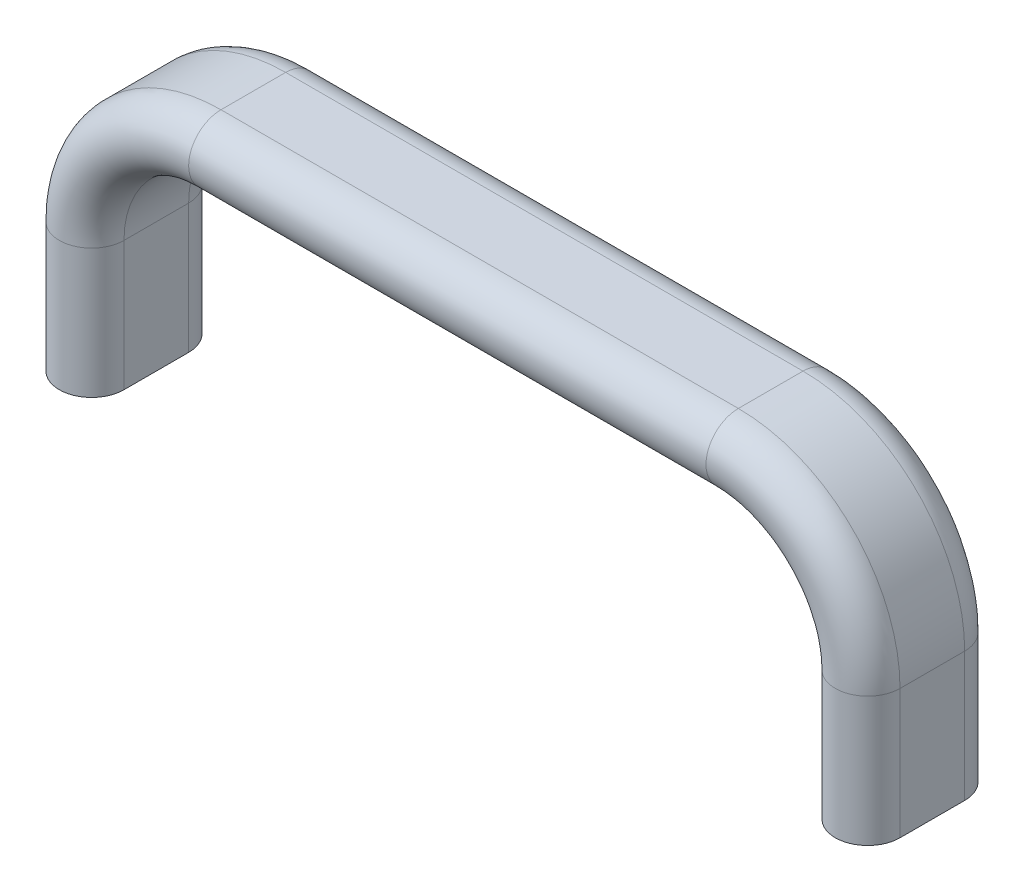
ISO-10303-21;
HEADER;
FILE_DESCRIPTION(('STEP AP214'),'2;1');
FILE_NAME('part.step','',(''),(''),'','','');
FILE_SCHEMA(('AUTOMOTIVE_DESIGN { 1 0 10303 214 1 1 1 1 }'));
ENDSEC;
DATA;
#1=APPLICATION_CONTEXT('core data for automotive mechanical design processes');
#2=APPLICATION_PROTOCOL_DEFINITION('international standard','automotive_design',2000,#1);
#3=PRODUCT_CONTEXT('',#1,'mechanical');
#4=PRODUCT('Part','Part','',(#3));
#5=PRODUCT_RELATED_PRODUCT_CATEGORY('part','',(#4));
#6=PRODUCT_DEFINITION_FORMATION('','',#4);
#7=PRODUCT_DEFINITION_CONTEXT('part definition',#1,'design');
#8=PRODUCT_DEFINITION('design','',#6,#7);
#9=PRODUCT_DEFINITION_SHAPE('','',#8);
#10=(LENGTH_UNIT() NAMED_UNIT(*) SI_UNIT(.MILLI.,.METRE.));
#11=(NAMED_UNIT(*) PLANE_ANGLE_UNIT() SI_UNIT($,.RADIAN.));
#12=(NAMED_UNIT(*) SI_UNIT($,.STERADIAN.) SOLID_ANGLE_UNIT());
#13=UNCERTAINTY_MEASURE_WITH_UNIT(LENGTH_MEASURE(1.E-05),#10,'distance_accuracy_value','');
#14=(GEOMETRIC_REPRESENTATION_CONTEXT(3) GLOBAL_UNCERTAINTY_ASSIGNED_CONTEXT((#13)) GLOBAL_UNIT_ASSIGNED_CONTEXT((#10,
#11,#12)) REPRESENTATION_CONTEXT('',''));
#15=CARTESIAN_POINT('',(0.,0.,0.));
#16=DIRECTION('',(0.,0.,1.));
#17=DIRECTION('',(1.,0.,0.));
#18=AXIS2_PLACEMENT_3D('',#15,#16,#17);
#19=CARTESIAN_POINT('',(60.,0.,-4.99999999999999));
#20=DIRECTION('',(0.,1.,0.));
#21=DIRECTION('',(0.,0.,-1.));
#22=AXIS2_PLACEMENT_3D('',#19,#20,#21);
#23=PLANE('',#22);
#24=CARTESIAN_POINT('',(60.,0.,-4.99999999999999));
#25=DIRECTION('',(0.,-1.,0.));
#26=DIRECTION('',(0.,0.,-1.));
#27=AXIS2_PLACEMENT_3D('',#24,#25,#26);
#28=CIRCLE('',#27,5.);
#29=CARTESIAN_POINT('',(55.,0.,-4.99999999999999));
#30=VERTEX_POINT('',#29);
#31=CARTESIAN_POINT('',(65.,0.,-4.99999999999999));
#32=VERTEX_POINT('',#31);
#33=EDGE_CURVE('E278',#30,#32,#28,.T.);
#34=ORIENTED_EDGE('',*,*,#33,.T.);
#35=DIRECTION('',(0.,0.,1.));
#36=VECTOR('',#35,1.);
#37=CARTESIAN_POINT('',(65.,0.,5.00000000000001));
#38=LINE('',#37,#36);
#39=CARTESIAN_POINT('',(65.,0.,5.00000000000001));
#40=VERTEX_POINT('',#39);
#41=EDGE_CURVE('E55',#32,#40,#38,.T.);
#42=ORIENTED_EDGE('',*,*,#41,.T.);
#43=CARTESIAN_POINT('',(60.,0.,5.00000000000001));
#44=DIRECTION('',(0.,-1.,0.));
#45=DIRECTION('',(0.,0.,1.));
#46=AXIS2_PLACEMENT_3D('',#43,#44,#45);
#47=CIRCLE('',#46,5.);
#48=CARTESIAN_POINT('',(55.,0.,5.00000000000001));
#49=VERTEX_POINT('',#48);
#50=EDGE_CURVE('E63',#40,#49,#47,.T.);
#51=ORIENTED_EDGE('',*,*,#50,.T.);
#52=DIRECTION('',(0.,0.,-1.));
#53=VECTOR('',#52,1.);
#54=CARTESIAN_POINT('',(55.,0.,-4.99999999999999));
#55=LINE('',#54,#53);
#56=EDGE_CURVE('E281',#49,#30,#55,.T.);
#57=ORIENTED_EDGE('',*,*,#56,.T.);
#58=EDGE_LOOP('',(#34,#42,#51,#57));
#59=FACE_BOUND('',#58,.T.);
#60=CARTESIAN_POINT('',(60.,0.,0.));
#61=DIRECTION('',(0.,1.,0.));
#62=DIRECTION('',(0.,0.,-1.));
#63=AXIS2_PLACEMENT_3D('',#60,#61,#62);
#64=CIRCLE('',#63,2.5);
#65=CARTESIAN_POINT('',(60.,0.,-2.5));
#66=VERTEX_POINT('',#65);
#67=EDGE_CURVE('E443',#66,#66,#64,.T.);
#68=ORIENTED_EDGE('',*,*,#67,.T.);
#69=EDGE_LOOP('',(#68));
#70=FACE_BOUND('',#69,.T.);
#71=ADVANCED_FACE('F37',(#59,#70),#23,.F.);
#72=CARTESIAN_POINT('',(65.,20.,5.00000000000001));
#73=DIRECTION('',(1.,0.,0.));
#74=DIRECTION('',(0.,0.,-1.));
#75=AXIS2_PLACEMENT_3D('',#72,#73,#74);
#76=PLANE('',#75);
#77=DIRECTION('',(0.,0.,1.));
#78=VECTOR('',#77,1.);
#79=CARTESIAN_POINT('',(65.,20.,5.00000000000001));
#80=LINE('',#79,#78);
#81=CARTESIAN_POINT('',(65.,20.,-4.99999999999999));
#82=VERTEX_POINT('',#81);
#83=CARTESIAN_POINT('',(65.,20.,5.00000000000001));
#84=VERTEX_POINT('',#83);
#85=EDGE_CURVE('E247',#82,#84,#80,.T.);
#86=ORIENTED_EDGE('',*,*,#85,.T.);
#87=DIRECTION('',(0.,-1.,0.));
#88=VECTOR('',#87,1.);
#89=CARTESIAN_POINT('',(65.,20.,5.00000000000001));
#90=LINE('',#89,#88);
#91=EDGE_CURVE('E47',#84,#40,#90,.T.);
#92=ORIENTED_EDGE('',*,*,#91,.T.);
#93=ORIENTED_EDGE('',*,*,#41,.F.);
#94=DIRECTION('',(0.,-1.,0.));
#95=VECTOR('',#94,1.);
#96=CARTESIAN_POINT('',(65.,20.,-4.99999999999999));
#97=LINE('',#96,#95);
#98=EDGE_CURVE('E11',#82,#32,#97,.T.);
#99=ORIENTED_EDGE('',*,*,#98,.F.);
#100=EDGE_LOOP('',(#86,#92,#93,#99));
#101=FACE_BOUND('',#100,.T.);
#102=ADVANCED_FACE('F39',(#101),#76,.T.);
#103=CARTESIAN_POINT('',(60.,20.,5.00000000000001));
#104=DIRECTION('',(0.,-1.,0.));
#105=DIRECTION('',(0.,0.,-1.));
#106=AXIS2_PLACEMENT_3D('',#103,#104,#105);
#107=CYLINDRICAL_SURFACE('',#106,5.);
#108=CARTESIAN_POINT('',(60.,20.,5.00000000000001));
#109=DIRECTION('',(0.,-1.,0.));
#110=DIRECTION('',(0.,0.,1.));
#111=AXIS2_PLACEMENT_3D('',#108,#109,#110);
#112=CIRCLE('',#111,5.);
#113=CARTESIAN_POINT('',(55.,20.,5.00000000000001));
#114=VERTEX_POINT('',#113);
#115=EDGE_CURVE('E240',#84,#114,#112,.T.);
#116=ORIENTED_EDGE('',*,*,#115,.T.);
#117=DIRECTION('',(0.,-1.,0.));
#118=VECTOR('',#117,1.);
#119=CARTESIAN_POINT('',(55.,20.,5.00000000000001));
#120=LINE('',#119,#118);
#121=EDGE_CURVE('E242',#114,#49,#120,.T.);
#122=ORIENTED_EDGE('',*,*,#121,.T.);
#123=ORIENTED_EDGE('',*,*,#50,.F.);
#124=ORIENTED_EDGE('',*,*,#91,.F.);
#125=EDGE_LOOP('',(#116,#122,#123,#124));
#126=FACE_BOUND('',#125,.T.);
#127=ADVANCED_FACE('F153',(#126),#107,.T.);
#128=CARTESIAN_POINT('',(55.,20.,-4.99999999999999));
#129=DIRECTION('',(-1.,0.,0.));
#130=DIRECTION('',(0.,0.,1.));
#131=AXIS2_PLACEMENT_3D('',#128,#129,#130);
#132=PLANE('',#131);
#133=DIRECTION('',(0.,0.,-1.));
#134=VECTOR('',#133,1.);
#135=CARTESIAN_POINT('',(55.,20.,-4.99999999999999));
#136=LINE('',#135,#134);
#137=CARTESIAN_POINT('',(55.,20.,-4.99999999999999));
#138=VERTEX_POINT('',#137);
#139=EDGE_CURVE('E248',#114,#138,#136,.T.);
#140=ORIENTED_EDGE('',*,*,#139,.T.);
#141=DIRECTION('',(0.,-1.,0.));
#142=VECTOR('',#141,1.);
#143=CARTESIAN_POINT('',(55.,20.,-4.99999999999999));
#144=LINE('',#143,#142);
#145=EDGE_CURVE('E289',#138,#30,#144,.T.);
#146=ORIENTED_EDGE('',*,*,#145,.T.);
#147=ORIENTED_EDGE('',*,*,#56,.F.);
#148=ORIENTED_EDGE('',*,*,#121,.F.);
#149=EDGE_LOOP('',(#140,#146,#147,#148));
#150=FACE_BOUND('',#149,.T.);
#151=ADVANCED_FACE('F231',(#150),#132,.T.);
#152=CARTESIAN_POINT('',(60.,20.,-4.99999999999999));
#153=DIRECTION('',(0.,-1.,0.));
#154=DIRECTION('',(0.,0.,-1.));
#155=AXIS2_PLACEMENT_3D('',#152,#153,#154);
#156=CYLINDRICAL_SURFACE('',#155,5.);
#157=CARTESIAN_POINT('',(60.,20.,-4.99999999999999));
#158=DIRECTION('',(0.,-1.,0.));
#159=DIRECTION('',(0.,0.,-1.));
#160=AXIS2_PLACEMENT_3D('',#157,#158,#159);
#161=CIRCLE('',#160,5.);
#162=EDGE_CURVE('E259',#138,#82,#161,.T.);
#163=ORIENTED_EDGE('',*,*,#162,.T.);
#164=ORIENTED_EDGE('',*,*,#98,.T.);
#165=ORIENTED_EDGE('',*,*,#33,.F.);
#166=ORIENTED_EDGE('',*,*,#145,.F.);
#167=EDGE_LOOP('',(#163,#164,#165,#166));
#168=FACE_BOUND('',#167,.T.);
#169=ADVANCED_FACE('F227',(#168),#156,.T.);
#170=CARTESIAN_POINT('',(40.,20.,0.));
#171=DIRECTION('',(0.,0.,-1.));
#172=DIRECTION('',(-1.,0.,0.));
#173=AXIS2_PLACEMENT_3D('',#170,#171,#172);
#174=CYLINDRICAL_SURFACE('',#173,25.);
#175=DIRECTION('',(0.,0.,1.));
#176=VECTOR('',#175,1.);
#177=CARTESIAN_POINT('',(40.,45.,5.00000000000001));
#178=LINE('',#177,#176);
#179=CARTESIAN_POINT('',(40.,45.,-4.99999999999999));
#180=VERTEX_POINT('',#179);
#181=CARTESIAN_POINT('',(40.,45.,5.00000000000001));
#182=VERTEX_POINT('',#181);
#183=EDGE_CURVE('E399',#180,#182,#178,.T.);
#184=ORIENTED_EDGE('',*,*,#183,.T.);
#185=CARTESIAN_POINT('',(40.,20.,5.00000000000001));
#186=DIRECTION('',(0.,0.,-1.));
#187=DIRECTION('',(-1.,0.,0.));
#188=AXIS2_PLACEMENT_3D('',#185,#186,#187);
#189=CIRCLE('',#188,25.);
#190=EDGE_CURVE('E265',#182,#84,#189,.T.);
#191=ORIENTED_EDGE('',*,*,#190,.T.);
#192=ORIENTED_EDGE('',*,*,#85,.F.);
#193=CARTESIAN_POINT('',(40.,20.,-4.99999999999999));
#194=DIRECTION('',(0.,0.,-1.));
#195=DIRECTION('',(-1.,0.,0.));
#196=AXIS2_PLACEMENT_3D('',#193,#194,#195);
#197=CIRCLE('',#196,25.);
#198=EDGE_CURVE('E269',#180,#82,#197,.T.);
#199=ORIENTED_EDGE('',*,*,#198,.F.);
#200=EDGE_LOOP('',(#184,#191,#192,#199));
#201=FACE_BOUND('',#200,.T.);
#202=ADVANCED_FACE('F223',(#201),#174,.T.);
#203=CARTESIAN_POINT('',(40.,20.,5.00000000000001));
#204=DIRECTION('',(0.,0.,-1.));
#205=DIRECTION('',(-1.,0.,0.));
#206=AXIS2_PLACEMENT_3D('',#203,#204,#205);
#207=TOROIDAL_SURFACE('',#206,20.,5.);
#208=CARTESIAN_POINT('',(40.,40.,5.00000000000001));
#209=DIRECTION('',(1.,0.,0.));
#210=DIRECTION('',(0.,0.,1.));
#211=AXIS2_PLACEMENT_3D('',#208,#209,#210);
#212=CIRCLE('',#211,5.);
#213=CARTESIAN_POINT('',(40.,35.,5.00000000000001));
#214=VERTEX_POINT('',#213);
#215=EDGE_CURVE('E262',#182,#214,#212,.T.);
#216=ORIENTED_EDGE('',*,*,#215,.T.);
#217=CARTESIAN_POINT('',(40.,20.,5.00000000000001));
#218=DIRECTION('',(0.,0.,-1.));
#219=DIRECTION('',(-1.,0.,0.));
#220=AXIS2_PLACEMENT_3D('',#217,#218,#219);
#221=CIRCLE('',#220,15.);
#222=EDGE_CURVE('E253',#214,#114,#221,.T.);
#223=ORIENTED_EDGE('',*,*,#222,.T.);
#224=ORIENTED_EDGE('',*,*,#115,.F.);
#225=ORIENTED_EDGE('',*,*,#190,.F.);
#226=EDGE_LOOP('',(#216,#223,#224,#225));
#227=FACE_BOUND('',#226,.T.);
#228=ADVANCED_FACE('F219',(#227),#207,.T.);
#229=CARTESIAN_POINT('',(40.,20.,0.));
#230=DIRECTION('',(0.,0.,-1.));
#231=DIRECTION('',(-1.,0.,0.));
#232=AXIS2_PLACEMENT_3D('',#229,#230,#231);
#233=CYLINDRICAL_SURFACE('',#232,15.);
#234=DIRECTION('',(0.,0.,-1.));
#235=VECTOR('',#234,1.);
#236=CARTESIAN_POINT('',(40.,35.,-4.99999999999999));
#237=LINE('',#236,#235);
#238=CARTESIAN_POINT('',(40.,35.,-4.99999999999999));
#239=VERTEX_POINT('',#238);
#240=EDGE_CURVE('E394',#214,#239,#237,.T.);
#241=ORIENTED_EDGE('',*,*,#240,.T.);
#242=CARTESIAN_POINT('',(40.,20.,-4.99999999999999));
#243=DIRECTION('',(0.,0.,-1.));
#244=DIRECTION('',(-1.,0.,0.));
#245=AXIS2_PLACEMENT_3D('',#242,#243,#244);
#246=CIRCLE('',#245,15.);
#247=EDGE_CURVE('E255',#239,#138,#246,.T.);
#248=ORIENTED_EDGE('',*,*,#247,.T.);
#249=ORIENTED_EDGE('',*,*,#139,.F.);
#250=ORIENTED_EDGE('',*,*,#222,.F.);
#251=EDGE_LOOP('',(#241,#248,#249,#250));
#252=FACE_BOUND('',#251,.T.);
#253=ADVANCED_FACE('F215',(#252),#233,.F.);
#254=CARTESIAN_POINT('',(40.,20.,-4.99999999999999));
#255=DIRECTION('',(0.,0.,-1.));
#256=DIRECTION('',(-1.,0.,0.));
#257=AXIS2_PLACEMENT_3D('',#254,#255,#256);
#258=TOROIDAL_SURFACE('',#257,20.,5.);
#259=CARTESIAN_POINT('',(40.,40.,-4.99999999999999));
#260=DIRECTION('',(1.,0.,0.));
#261=DIRECTION('',(0.,0.,-1.));
#262=AXIS2_PLACEMENT_3D('',#259,#260,#261);
#263=CIRCLE('',#262,5.);
#264=EDGE_CURVE('E390',#239,#180,#263,.T.);
#265=ORIENTED_EDGE('',*,*,#264,.T.);
#266=ORIENTED_EDGE('',*,*,#198,.T.);
#267=ORIENTED_EDGE('',*,*,#162,.F.);
#268=ORIENTED_EDGE('',*,*,#247,.F.);
#269=EDGE_LOOP('',(#265,#266,#267,#268));
#270=FACE_BOUND('',#269,.T.);
#271=ADVANCED_FACE('F211',(#270),#258,.T.);
#272=CARTESIAN_POINT('',(-40.,45.,5.00000000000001));
#273=DIRECTION('',(0.,1.,0.));
#274=DIRECTION('',(-1.,0.,0.));
#275=AXIS2_PLACEMENT_3D('',#272,#273,#274);
#276=PLANE('',#275);
#277=DIRECTION('',(0.,0.,1.));
#278=VECTOR('',#277,1.);
#279=CARTESIAN_POINT('',(-40.,45.,5.00000000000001));
#280=LINE('',#279,#278);
#281=CARTESIAN_POINT('',(-40.,45.,-4.99999999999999));
#282=VERTEX_POINT('',#281);
#283=CARTESIAN_POINT('',(-40.,45.,5.00000000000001));
#284=VERTEX_POINT('',#283);
#285=EDGE_CURVE('E371',#282,#284,#280,.T.);
#286=ORIENTED_EDGE('',*,*,#285,.T.);
#287=DIRECTION('',(1.,0.,0.));
#288=VECTOR('',#287,1.);
#289=CARTESIAN_POINT('',(-40.,45.,5.00000000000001));
#290=LINE('',#289,#288);
#291=EDGE_CURVE('E411',#284,#182,#290,.T.);
#292=ORIENTED_EDGE('',*,*,#291,.T.);
#293=ORIENTED_EDGE('',*,*,#183,.F.);
#294=DIRECTION('',(1.,0.,0.));
#295=VECTOR('',#294,1.);
#296=CARTESIAN_POINT('',(-40.,45.,-4.99999999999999));
#297=LINE('',#296,#295);
#298=EDGE_CURVE('E415',#282,#180,#297,.T.);
#299=ORIENTED_EDGE('',*,*,#298,.F.);
#300=EDGE_LOOP('',(#286,#292,#293,#299));
#301=FACE_BOUND('',#300,.T.);
#302=ADVANCED_FACE('F207',(#301),#276,.T.);
#303=CARTESIAN_POINT('',(-40.,40.,5.00000000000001));
#304=DIRECTION('',(1.,0.,0.));
#305=DIRECTION('',(0.,1.,0.));
#306=AXIS2_PLACEMENT_3D('',#303,#304,#305);
#307=CYLINDRICAL_SURFACE('',#306,5.);
#308=CARTESIAN_POINT('',(-40.,40.,5.00000000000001));
#309=DIRECTION('',(1.,0.,0.));
#310=DIRECTION('',(0.,0.,1.));
#311=AXIS2_PLACEMENT_3D('',#308,#309,#310);
#312=CIRCLE('',#311,5.);
#313=CARTESIAN_POINT('',(-40.,35.,5.00000000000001));
#314=VERTEX_POINT('',#313);
#315=EDGE_CURVE('E367',#284,#314,#312,.T.);
#316=ORIENTED_EDGE('',*,*,#315,.T.);
#317=DIRECTION('',(1.,0.,0.));
#318=VECTOR('',#317,1.);
#319=CARTESIAN_POINT('',(-40.,35.,5.00000000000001));
#320=LINE('',#319,#318);
#321=EDGE_CURVE('E407',#314,#214,#320,.T.);
#322=ORIENTED_EDGE('',*,*,#321,.T.);
#323=ORIENTED_EDGE('',*,*,#215,.F.);
#324=ORIENTED_EDGE('',*,*,#291,.F.);
#325=EDGE_LOOP('',(#316,#322,#323,#324));
#326=FACE_BOUND('',#325,.T.);
#327=ADVANCED_FACE('F203',(#326),#307,.T.);
#328=CARTESIAN_POINT('',(-40.,35.,-4.99999999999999));
#329=DIRECTION('',(0.,-1.,0.));
#330=DIRECTION('',(1.,0.,0.));
#331=AXIS2_PLACEMENT_3D('',#328,#329,#330);
#332=PLANE('',#331);
#333=DIRECTION('',(0.,0.,-1.));
#334=VECTOR('',#333,1.);
#335=CARTESIAN_POINT('',(-40.,35.,-4.99999999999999));
#336=LINE('',#335,#334);
#337=CARTESIAN_POINT('',(-40.,35.,-4.99999999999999));
#338=VERTEX_POINT('',#337);
#339=EDGE_CURVE('E363',#314,#338,#336,.T.);
#340=ORIENTED_EDGE('',*,*,#339,.T.);
#341=DIRECTION('',(1.,0.,0.));
#342=VECTOR('',#341,1.);
#343=CARTESIAN_POINT('',(-40.,35.,-4.99999999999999));
#344=LINE('',#343,#342);
#345=EDGE_CURVE('E403',#338,#239,#344,.T.);
#346=ORIENTED_EDGE('',*,*,#345,.T.);
#347=ORIENTED_EDGE('',*,*,#240,.F.);
#348=ORIENTED_EDGE('',*,*,#321,.F.);
#349=EDGE_LOOP('',(#340,#346,#347,#348));
#350=FACE_BOUND('',#349,.T.);
#351=ADVANCED_FACE('F199',(#350),#332,.T.);
#352=CARTESIAN_POINT('',(-40.,40.,-4.99999999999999));
#353=DIRECTION('',(1.,0.,0.));
#354=DIRECTION('',(0.,1.,0.));
#355=AXIS2_PLACEMENT_3D('',#352,#353,#354);
#356=CYLINDRICAL_SURFACE('',#355,5.);
#357=CARTESIAN_POINT('',(-40.,40.,-4.99999999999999));
#358=DIRECTION('',(1.,0.,0.));
#359=DIRECTION('',(0.,0.,-1.));
#360=AXIS2_PLACEMENT_3D('',#357,#358,#359);
#361=CIRCLE('',#360,5.);
#362=EDGE_CURVE('E359',#338,#282,#361,.T.);
#363=ORIENTED_EDGE('',*,*,#362,.T.);
#364=ORIENTED_EDGE('',*,*,#298,.T.);
#365=ORIENTED_EDGE('',*,*,#264,.F.);
#366=ORIENTED_EDGE('',*,*,#345,.F.);
#367=EDGE_LOOP('',(#363,#364,#365,#366));
#368=FACE_BOUND('',#367,.T.);
#369=ADVANCED_FACE('F195',(#368),#356,.T.);
#370=CARTESIAN_POINT('',(-40.,20.,0.));
#371=DIRECTION('',(0.,0.,-1.));
#372=DIRECTION('',(-1.,0.,0.));
#373=AXIS2_PLACEMENT_3D('',#370,#371,#372);
#374=CYLINDRICAL_SURFACE('',#373,25.);
#375=DIRECTION('',(0.,0.,1.));
#376=VECTOR('',#375,1.);
#377=CARTESIAN_POINT('',(-65.,20.,5.00000000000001));
#378=LINE('',#377,#376);
#379=CARTESIAN_POINT('',(-65.,20.,-4.99999999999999));
#380=VERTEX_POINT('',#379);
#381=CARTESIAN_POINT('',(-65.,20.,5.00000000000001));
#382=VERTEX_POINT('',#381);
#383=EDGE_CURVE('E324',#380,#382,#378,.T.);
#384=ORIENTED_EDGE('',*,*,#383,.T.);
#385=CARTESIAN_POINT('',(-40.,20.,5.00000000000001));
#386=DIRECTION('',(0.,0.,-1.));
#387=DIRECTION('',(-1.,0.,0.));
#388=AXIS2_PLACEMENT_3D('',#385,#386,#387);
#389=CIRCLE('',#388,25.);
#390=EDGE_CURVE('E383',#382,#284,#389,.T.);
#391=ORIENTED_EDGE('',*,*,#390,.T.);
#392=ORIENTED_EDGE('',*,*,#285,.F.);
#393=CARTESIAN_POINT('',(-40.,20.,-4.99999999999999));
#394=DIRECTION('',(0.,0.,-1.));
#395=DIRECTION('',(-1.,0.,0.));
#396=AXIS2_PLACEMENT_3D('',#393,#394,#395);
#397=CIRCLE('',#396,25.);
#398=EDGE_CURVE('E387',#380,#282,#397,.T.);
#399=ORIENTED_EDGE('',*,*,#398,.F.);
#400=EDGE_LOOP('',(#384,#391,#392,#399));
#401=FACE_BOUND('',#400,.T.);
#402=ADVANCED_FACE('F191',(#401),#374,.T.);
#403=CARTESIAN_POINT('',(-40.,20.,5.00000000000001));
#404=DIRECTION('',(0.,0.,-1.));
#405=DIRECTION('',(-1.,0.,0.));
#406=AXIS2_PLACEMENT_3D('',#403,#404,#405);
#407=TOROIDAL_SURFACE('',#406,20.,5.);
#408=CARTESIAN_POINT('',(-60.,20.,5.00000000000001));
#409=DIRECTION('',(0.,1.,0.));
#410=DIRECTION('',(0.,0.,1.));
#411=AXIS2_PLACEMENT_3D('',#408,#409,#410);
#412=CIRCLE('',#411,5.);
#413=CARTESIAN_POINT('',(-55.,20.,5.00000000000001));
#414=VERTEX_POINT('',#413);
#415=EDGE_CURVE('E329',#382,#414,#412,.T.);
#416=ORIENTED_EDGE('',*,*,#415,.T.);
#417=CARTESIAN_POINT('',(-40.,20.,5.00000000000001));
#418=DIRECTION('',(0.,0.,-1.));
#419=DIRECTION('',(-1.,0.,0.));
#420=AXIS2_PLACEMENT_3D('',#417,#418,#419);
#421=CIRCLE('',#420,15.);
#422=EDGE_CURVE('E379',#414,#314,#421,.T.);
#423=ORIENTED_EDGE('',*,*,#422,.T.);
#424=ORIENTED_EDGE('',*,*,#315,.F.);
#425=ORIENTED_EDGE('',*,*,#390,.F.);
#426=EDGE_LOOP('',(#416,#423,#424,#425));
#427=FACE_BOUND('',#426,.T.);
#428=ADVANCED_FACE('F187',(#427),#407,.T.);
#429=CARTESIAN_POINT('',(-40.,20.,0.));
#430=DIRECTION('',(0.,0.,-1.));
#431=DIRECTION('',(-1.,0.,0.));
#432=AXIS2_PLACEMENT_3D('',#429,#430,#431);
#433=CYLINDRICAL_SURFACE('',#432,15.);
#434=DIRECTION('',(0.,0.,-1.));
#435=VECTOR('',#434,1.);
#436=CARTESIAN_POINT('',(-55.,20.,-4.99999999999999));
#437=LINE('',#436,#435);
#438=CARTESIAN_POINT('',(-55.,20.,-4.99999999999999));
#439=VERTEX_POINT('',#438);
#440=EDGE_CURVE('E333',#414,#439,#437,.T.);
#441=ORIENTED_EDGE('',*,*,#440,.T.);
#442=CARTESIAN_POINT('',(-40.,20.,-4.99999999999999));
#443=DIRECTION('',(0.,0.,-1.));
#444=DIRECTION('',(-1.,0.,0.));
#445=AXIS2_PLACEMENT_3D('',#442,#443,#444);
#446=CIRCLE('',#445,15.);
#447=EDGE_CURVE('E375',#439,#338,#446,.T.);
#448=ORIENTED_EDGE('',*,*,#447,.T.);
#449=ORIENTED_EDGE('',*,*,#339,.F.);
#450=ORIENTED_EDGE('',*,*,#422,.F.);
#451=EDGE_LOOP('',(#441,#448,#449,#450));
#452=FACE_BOUND('',#451,.T.);
#453=ADVANCED_FACE('F183',(#452),#433,.F.);
#454=CARTESIAN_POINT('',(-40.,20.,-4.99999999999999));
#455=DIRECTION('',(0.,0.,-1.));
#456=DIRECTION('',(-1.,0.,0.));
#457=AXIS2_PLACEMENT_3D('',#454,#455,#456);
#458=TOROIDAL_SURFACE('',#457,20.,5.);
#459=CARTESIAN_POINT('',(-60.,20.,-4.99999999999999));
#460=DIRECTION('',(0.,1.,0.));
#461=DIRECTION('',(0.,0.,-1.));
#462=AXIS2_PLACEMENT_3D('',#459,#460,#461);
#463=CIRCLE('',#462,5.);
#464=EDGE_CURVE('E320',#439,#380,#463,.T.);
#465=ORIENTED_EDGE('',*,*,#464,.T.);
#466=ORIENTED_EDGE('',*,*,#398,.T.);
#467=ORIENTED_EDGE('',*,*,#362,.F.);
#468=ORIENTED_EDGE('',*,*,#447,.F.);
#469=EDGE_LOOP('',(#465,#466,#467,#468));
#470=FACE_BOUND('',#469,.T.);
#471=ADVANCED_FACE('F179',(#470),#458,.T.);
#472=CARTESIAN_POINT('',(-60.,20.,-4.99999999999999));
#473=DIRECTION('',(0.,-1.,0.));
#474=DIRECTION('',(0.,0.,-1.));
#475=AXIS2_PLACEMENT_3D('',#472,#473,#474);
#476=CYLINDRICAL_SURFACE('',#475,5.);
#477=CARTESIAN_POINT('',(-60.,0.,-4.99999999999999));
#478=DIRECTION('',(0.,1.,0.));
#479=DIRECTION('',(0.,0.,-1.));
#480=AXIS2_PLACEMENT_3D('',#477,#478,#479);
#481=CIRCLE('',#480,5.);
#482=CARTESIAN_POINT('',(-55.,0.,-4.99999999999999));
#483=VERTEX_POINT('',#482);
#484=CARTESIAN_POINT('',(-65.,0.,-4.99999999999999));
#485=VERTEX_POINT('',#484);
#486=EDGE_CURVE('E298',#483,#485,#481,.T.);
#487=ORIENTED_EDGE('',*,*,#486,.T.);
#488=DIRECTION('',(0.,-1.,0.));
#489=VECTOR('',#488,1.);
#490=CARTESIAN_POINT('',(-65.,20.,-4.99999999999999));
#491=LINE('',#490,#489);
#492=EDGE_CURVE('E356',#380,#485,#491,.T.);
#493=ORIENTED_EDGE('',*,*,#492,.F.);
#494=ORIENTED_EDGE('',*,*,#464,.F.);
#495=DIRECTION('',(0.,-1.,0.));
#496=VECTOR('',#495,1.);
#497=CARTESIAN_POINT('',(-55.,20.,-4.99999999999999));
#498=LINE('',#497,#496);
#499=EDGE_CURVE('E336',#439,#483,#498,.T.);
#500=ORIENTED_EDGE('',*,*,#499,.T.);
#501=EDGE_LOOP('',(#487,#493,#494,#500));
#502=FACE_BOUND('',#501,.T.);
#503=ADVANCED_FACE('F175',(#502),#476,.T.);
#504=CARTESIAN_POINT('',(-65.,20.,5.00000000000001));
#505=DIRECTION('',(1.,0.,0.));
#506=DIRECTION('',(0.,0.,-1.));
#507=AXIS2_PLACEMENT_3D('',#504,#505,#506);
#508=PLANE('',#507);
#509=DIRECTION('',(0.,0.,1.));
#510=VECTOR('',#509,1.);
#511=CARTESIAN_POINT('',(-65.,0.,5.00000000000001));
#512=LINE('',#511,#510);
#513=CARTESIAN_POINT('',(-65.,0.,5.00000000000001));
#514=VERTEX_POINT('',#513);
#515=EDGE_CURVE('E305',#485,#514,#512,.T.);
#516=ORIENTED_EDGE('',*,*,#515,.T.);
#517=DIRECTION('',(0.,-1.,0.));
#518=VECTOR('',#517,1.);
#519=CARTESIAN_POINT('',(-65.,20.,5.00000000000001));
#520=LINE('',#519,#518);
#521=EDGE_CURVE('E352',#382,#514,#520,.T.);
#522=ORIENTED_EDGE('',*,*,#521,.F.);
#523=ORIENTED_EDGE('',*,*,#383,.F.);
#524=ORIENTED_EDGE('',*,*,#492,.T.);
#525=EDGE_LOOP('',(#516,#522,#523,#524));
#526=FACE_BOUND('',#525,.T.);
#527=ADVANCED_FACE('F171',(#526),#508,.F.);
#528=CARTESIAN_POINT('',(-60.,20.,5.00000000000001));
#529=DIRECTION('',(0.,-1.,0.));
#530=DIRECTION('',(0.,0.,-1.));
#531=AXIS2_PLACEMENT_3D('',#528,#529,#530);
#532=CYLINDRICAL_SURFACE('',#531,5.);
#533=CARTESIAN_POINT('',(-60.,0.,5.00000000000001));
#534=DIRECTION('',(0.,1.,0.));
#535=DIRECTION('',(0.,0.,1.));
#536=AXIS2_PLACEMENT_3D('',#533,#534,#535);
#537=CIRCLE('',#536,5.);
#538=CARTESIAN_POINT('',(-55.,0.,5.00000000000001));
#539=VERTEX_POINT('',#538);
#540=EDGE_CURVE('E340',#514,#539,#537,.T.);
#541=ORIENTED_EDGE('',*,*,#540,.T.);
#542=DIRECTION('',(0.,-1.,0.));
#543=VECTOR('',#542,1.);
#544=CARTESIAN_POINT('',(-55.,20.,5.00000000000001));
#545=LINE('',#544,#543);
#546=EDGE_CURVE('E348',#414,#539,#545,.T.);
#547=ORIENTED_EDGE('',*,*,#546,.F.);
#548=ORIENTED_EDGE('',*,*,#415,.F.);
#549=ORIENTED_EDGE('',*,*,#521,.T.);
#550=EDGE_LOOP('',(#541,#547,#548,#549));
#551=FACE_BOUND('',#550,.T.);
#552=ADVANCED_FACE('F167',(#551),#532,.T.);
#553=CARTESIAN_POINT('',(-55.,20.,-4.99999999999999));
#554=DIRECTION('',(-1.,0.,0.));
#555=DIRECTION('',(0.,0.,1.));
#556=AXIS2_PLACEMENT_3D('',#553,#554,#555);
#557=PLANE('',#556);
#558=DIRECTION('',(0.,0.,-1.));
#559=VECTOR('',#558,1.);
#560=CARTESIAN_POINT('',(-55.,0.,-4.99999999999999));
#561=LINE('',#560,#559);
#562=EDGE_CURVE('E325',#539,#483,#561,.T.);
#563=ORIENTED_EDGE('',*,*,#562,.T.);
#564=ORIENTED_EDGE('',*,*,#499,.F.);
#565=ORIENTED_EDGE('',*,*,#440,.F.);
#566=ORIENTED_EDGE('',*,*,#546,.T.);
#567=EDGE_LOOP('',(#563,#564,#565,#566));
#568=FACE_BOUND('',#567,.T.);
#569=ADVANCED_FACE('F163',(#568),#557,.F.);
#570=CARTESIAN_POINT('',(-60.,0.,-4.99999999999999));
#571=DIRECTION('',(0.,-1.,0.));
#572=DIRECTION('',(0.,0.,-1.));
#573=AXIS2_PLACEMENT_3D('',#570,#571,#572);
#574=PLANE('',#573);
#575=CARTESIAN_POINT('',(-60.,0.,0.));
#576=DIRECTION('',(0.,-1.,0.));
#577=DIRECTION('',(0.,0.,-1.));
#578=AXIS2_PLACEMENT_3D('',#575,#576,#577);
#579=CIRCLE('',#578,2.5);
#580=CARTESIAN_POINT('',(-60.,0.,-2.5));
#581=VERTEX_POINT('',#580);
#582=EDGE_CURVE('E309',#581,#581,#579,.T.);
#583=ORIENTED_EDGE('',*,*,#582,.F.);
#584=EDGE_LOOP('',(#583));
#585=FACE_BOUND('',#584,.T.);
#586=ORIENTED_EDGE('',*,*,#486,.F.);
#587=ORIENTED_EDGE('',*,*,#562,.F.);
#588=ORIENTED_EDGE('',*,*,#540,.F.);
#589=ORIENTED_EDGE('',*,*,#515,.F.);
#590=EDGE_LOOP('',(#586,#587,#588,#589));
#591=FACE_BOUND('',#590,.T.);
#592=ADVANCED_FACE('F159',(#585,#591),#574,.T.);
#593=CARTESIAN_POINT('',(-60.,10.,0.));
#594=DIRECTION('',(0.,-1.,0.));
#595=DIRECTION('',(0.,0.,-1.));
#596=AXIS2_PLACEMENT_3D('',#593,#594,#595);
#597=PLANE('',#596);
#598=CARTESIAN_POINT('',(-60.,10.,0.));
#599=DIRECTION('',(0.,-1.,0.));
#600=DIRECTION('',(0.,0.,-1.));
#601=AXIS2_PLACEMENT_3D('',#598,#599,#600);
#602=CIRCLE('',#601,2.5);
#603=CARTESIAN_POINT('',(-60.,10.,-2.5));
#604=VERTEX_POINT('',#603);
#605=EDGE_CURVE('E299',#604,#604,#602,.T.);
#606=ORIENTED_EDGE('',*,*,#605,.T.);
#607=EDGE_LOOP('',(#606));
#608=FACE_BOUND('',#607,.T.);
#609=CARTESIAN_POINT('',(-60.,10.,0.));
#610=DIRECTION('',(0.,-1.,0.));
#611=DIRECTION('',(0.,0.,-1.));
#612=AXIS2_PLACEMENT_3D('',#609,#610,#611);
#613=CIRCLE('',#612,2.1);
#614=CARTESIAN_POINT('',(-60.,10.,-2.1));
#615=VERTEX_POINT('',#614);
#616=EDGE_CURVE('E295',#615,#615,#613,.F.);
#617=ORIENTED_EDGE('',*,*,#616,.T.);
#618=EDGE_LOOP('',(#617));
#619=FACE_BOUND('',#618,.T.);
#620=ADVANCED_FACE('F162',(#608,#619),#597,.T.);
#621=CARTESIAN_POINT('',(-60.,10.,0.));
#622=DIRECTION('',(0.,-1.,0.));
#623=DIRECTION('',(0.,0.,-1.));
#624=AXIS2_PLACEMENT_3D('',#621,#622,#623);
#625=CYLINDRICAL_SURFACE('',#624,2.5);
#626=ORIENTED_EDGE('',*,*,#605,.F.);
#627=EDGE_LOOP('',(#626));
#628=FACE_BOUND('',#627,.T.);
#629=ORIENTED_EDGE('',*,*,#582,.T.);
#630=EDGE_LOOP('',(#629));
#631=FACE_BOUND('',#630,.T.);
#632=ADVANCED_FACE('F474',(#628,#631),#625,.F.);
#633=CARTESIAN_POINT('',(-60.,12.5,0.));
#634=DIRECTION('',(0.,-1.,0.));
#635=DIRECTION('',(0.,0.,-1.));
#636=AXIS2_PLACEMENT_3D('',#633,#634,#635);
#637=CYLINDRICAL_SURFACE('',#636,2.1);
#638=CARTESIAN_POINT('',(-60.,12.5,0.));
#639=DIRECTION('',(0.,1.,0.));
#640=DIRECTION('',(0.,0.,1.));
#641=AXIS2_PLACEMENT_3D('',#638,#639,#640);
#642=CIRCLE('',#641,2.1);
#643=CARTESIAN_POINT('',(-60.,12.5,2.1));
#644=VERTEX_POINT('',#643);
#645=EDGE_CURVE('E315',#644,#644,#642,.T.);
#646=ORIENTED_EDGE('',*,*,#645,.T.);
#647=EDGE_LOOP('',(#646));
#648=FACE_BOUND('',#647,.T.);
#649=ORIENTED_EDGE('',*,*,#616,.F.);
#650=EDGE_LOOP('',(#649));
#651=FACE_BOUND('',#650,.T.);
#652=ADVANCED_FACE('F157',(#648,#651),#637,.F.);
#653=CARTESIAN_POINT('',(-60.,13.7124355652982,0.));
#654=DIRECTION('',(0.,-1.,0.));
#655=DIRECTION('',(0.,0.,-1.));
#656=AXIS2_PLACEMENT_3D('',#653,#654,#655);
#657=CONICAL_SURFACE('',#656,0.,1.0471975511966);
#658=ORIENTED_EDGE('',*,*,#645,.F.);
#659=EDGE_LOOP('',(#658));
#660=FACE_BOUND('',#659,.T.);
#661=CARTESIAN_POINT('',(-60.,13.7124355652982,0.));
#662=VERTEX_POINT('',#661);
#663=VERTEX_LOOP('',#662);
#664=FACE_BOUND('',#663,.T.);
#665=ADVANCED_FACE('F464',(#660,#664),#657,.F.);
#666=CARTESIAN_POINT('',(60.,10.,0.));
#667=DIRECTION('',(0.,-1.,0.));
#668=DIRECTION('',(0.,0.,-1.));
#669=AXIS2_PLACEMENT_3D('',#666,#667,#668);
#670=CYLINDRICAL_SURFACE('',#669,2.5);
#671=CARTESIAN_POINT('',(60.,10.,0.));
#672=DIRECTION('',(0.,1.,0.));
#673=DIRECTION('',(0.,0.,-1.));
#674=AXIS2_PLACEMENT_3D('',#671,#672,#673);
#675=CIRCLE('',#674,2.5);
#676=CARTESIAN_POINT('',(60.,10.,-2.5));
#677=VERTEX_POINT('',#676);
#678=EDGE_CURVE('E448',#677,#677,#675,.T.);
#679=ORIENTED_EDGE('',*,*,#678,.T.);
#680=EDGE_LOOP('',(#679));
#681=FACE_BOUND('',#680,.T.);
#682=ORIENTED_EDGE('',*,*,#67,.F.);
#683=EDGE_LOOP('',(#682));
#684=FACE_BOUND('',#683,.T.);
#685=ADVANCED_FACE('F467',(#681,#684),#670,.F.);
#686=CARTESIAN_POINT('',(60.,10.,0.));
#687=DIRECTION('',(0.,-1.,0.));
#688=DIRECTION('',(0.,0.,-1.));
#689=AXIS2_PLACEMENT_3D('',#686,#687,#688);
#690=PLANE('',#689);
#691=CARTESIAN_POINT('',(60.,10.,0.));
#692=DIRECTION('',(0.,-1.,0.));
#693=DIRECTION('',(0.,0.,-1.));
#694=AXIS2_PLACEMENT_3D('',#691,#692,#693);
#695=CIRCLE('',#694,2.1);
#696=CARTESIAN_POINT('',(60.,10.,-2.1));
#697=VERTEX_POINT('',#696);
#698=EDGE_CURVE('E41',#697,#697,#695,.T.);
#699=ORIENTED_EDGE('',*,*,#698,.F.);
#700=EDGE_LOOP('',(#699));
#701=FACE_BOUND('',#700,.T.);
#702=ORIENTED_EDGE('',*,*,#678,.F.);
#703=EDGE_LOOP('',(#702));
#704=FACE_BOUND('',#703,.T.);
#705=ADVANCED_FACE('F142',(#701,#704),#690,.T.);
#706=CARTESIAN_POINT('',(60.,12.5,0.));
#707=DIRECTION('',(0.,-1.,0.));
#708=DIRECTION('',(0.,0.,-1.));
#709=AXIS2_PLACEMENT_3D('',#706,#707,#708);
#710=CYLINDRICAL_SURFACE('',#709,2.1);
#711=CARTESIAN_POINT('',(60.,12.5,0.));
#712=DIRECTION('',(0.,-1.,0.));
#713=DIRECTION('',(0.,0.,1.));
#714=AXIS2_PLACEMENT_3D('',#711,#712,#713);
#715=CIRCLE('',#714,2.1);
#716=CARTESIAN_POINT('',(60.,12.5,2.1));
#717=VERTEX_POINT('',#716);
#718=EDGE_CURVE('E442',#717,#717,#715,.T.);
#719=ORIENTED_EDGE('',*,*,#718,.F.);
#720=EDGE_LOOP('',(#719));
#721=FACE_BOUND('',#720,.T.);
#722=ORIENTED_EDGE('',*,*,#698,.T.);
#723=EDGE_LOOP('',(#722));
#724=FACE_BOUND('',#723,.T.);
#725=ADVANCED_FACE('F136',(#721,#724),#710,.F.);
#726=CARTESIAN_POINT('',(60.,13.7124355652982,0.));
#727=DIRECTION('',(0.,-1.,0.));
#728=DIRECTION('',(0.,0.,-1.));
#729=AXIS2_PLACEMENT_3D('',#726,#727,#728);
#730=CONICAL_SURFACE('',#729,0.,1.0471975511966);
#731=ORIENTED_EDGE('',*,*,#718,.T.);
#732=EDGE_LOOP('',(#731));
#733=FACE_BOUND('',#732,.T.);
#734=CARTESIAN_POINT('',(60.,13.7124355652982,0.));
#735=VERTEX_POINT('',#734);
#736=VERTEX_LOOP('',#735);
#737=FACE_BOUND('',#736,.T.);
#738=ADVANCED_FACE('F134',(#733,#737),#730,.F.);
#739=CLOSED_SHELL('',(#71,#102,#127,#151,#169,#202,#228,#253,#271,#302,#327,#351,#369,#402,#428,
#453,#471,#503,#527,#552,#569,#592,#620,#632,#652,#665,#685,#705,#725,#738));
#740=MANIFOLD_SOLID_BREP('B2',#739);
#741=ADVANCED_BREP_SHAPE_REPRESENTATION('',(#18,#740),#14);
#742=SHAPE_DEFINITION_REPRESENTATION(#9,#741);
ENDSEC;
END-ISO-10303-21;
